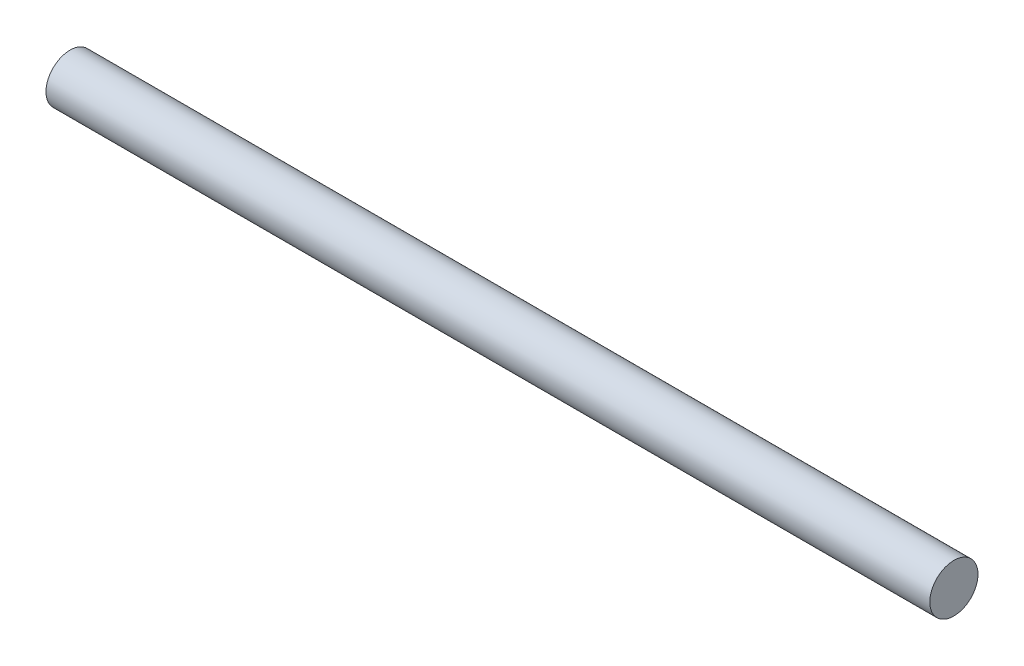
from build123d import *

# Parameters (mm, degrees)
SKETCH1_W = 1485.9
SKETCH1_H = 40.513


with BuildPart() as part:
    # Sketch1 → Revolve1 (revolve)
    with BuildSketch(Plane.XY, mode=Mode.PRIVATE) as revolve1_sk:
        with Locations((742.95, -20.2565)):
            Rectangle(SKETCH1_W, SKETCH1_H)
    revolve(revolve1_sk.sketch.rotate(Axis((0, 0, 0), (-1, 0, 0)), 270), axis=Axis((0, 0, 0), (-1, 0, 0)))


solid = part.part
